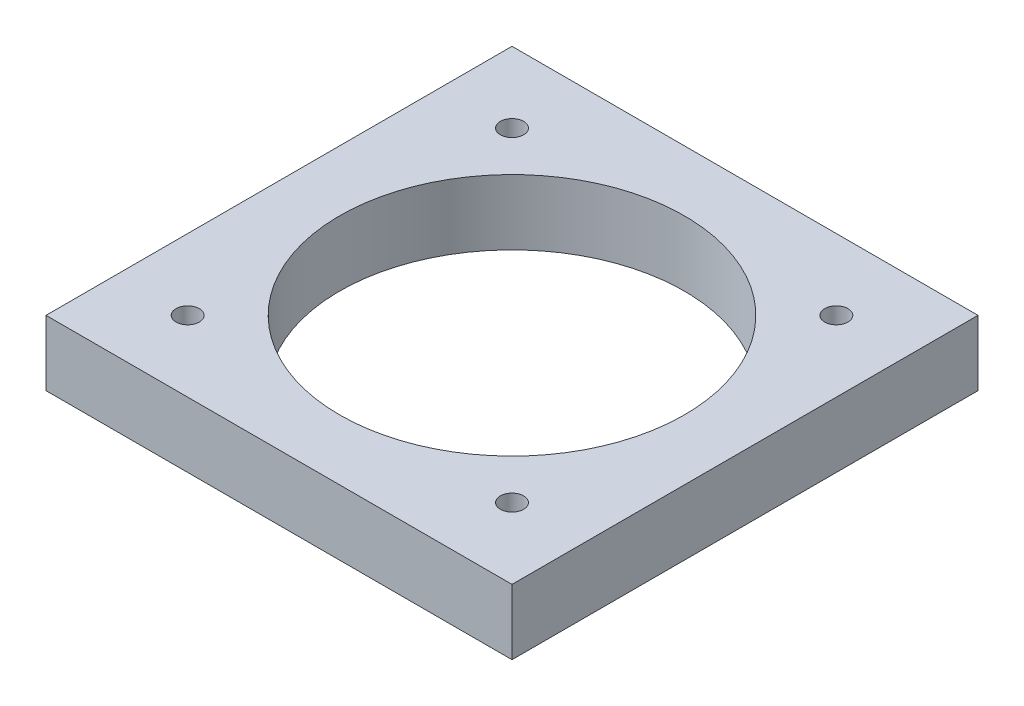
ISO-10303-21;
HEADER;
FILE_DESCRIPTION(('STEP AP214'),'2;1');
FILE_NAME('part.step','',(''),(''),'','','');
FILE_SCHEMA(('AUTOMOTIVE_DESIGN { 1 0 10303 214 1 1 1 1 }'));
ENDSEC;
DATA;
#1=APPLICATION_CONTEXT('core data for automotive mechanical design processes');
#2=APPLICATION_PROTOCOL_DEFINITION('international standard','automotive_design',2000,#1);
#3=PRODUCT_CONTEXT('',#1,'mechanical');
#4=PRODUCT('Part','Part','',(#3));
#5=PRODUCT_RELATED_PRODUCT_CATEGORY('part','',(#4));
#6=PRODUCT_DEFINITION_FORMATION('','',#4);
#7=PRODUCT_DEFINITION_CONTEXT('part definition',#1,'design');
#8=PRODUCT_DEFINITION('design','',#6,#7);
#9=PRODUCT_DEFINITION_SHAPE('','',#8);
#10=(LENGTH_UNIT() NAMED_UNIT(*) SI_UNIT(.MILLI.,.METRE.));
#11=(NAMED_UNIT(*) PLANE_ANGLE_UNIT() SI_UNIT($,.RADIAN.));
#12=(NAMED_UNIT(*) SI_UNIT($,.STERADIAN.) SOLID_ANGLE_UNIT());
#13=UNCERTAINTY_MEASURE_WITH_UNIT(LENGTH_MEASURE(1.E-05),#10,'distance_accuracy_value','');
#14=(GEOMETRIC_REPRESENTATION_CONTEXT(3) GLOBAL_UNCERTAINTY_ASSIGNED_CONTEXT((#13)) GLOBAL_UNIT_ASSIGNED_CONTEXT((#10,
#11,#12)) REPRESENTATION_CONTEXT('',''));
#15=CARTESIAN_POINT('',(0.,0.,0.));
#16=DIRECTION('',(0.,0.,1.));
#17=DIRECTION('',(1.,0.,0.));
#18=AXIS2_PLACEMENT_3D('',#15,#16,#17);
#19=CARTESIAN_POINT('',(26.,7.,-30.2499999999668));
#20=DIRECTION('',(0.,0.,-1.));
#21=DIRECTION('',(-1.,0.,0.));
#22=AXIS2_PLACEMENT_3D('',#19,#20,#21);
#23=CONICAL_SURFACE('',#22,3.39999999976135,1.0297442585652);
#24=CARTESIAN_POINT('',(25.9999999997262,7.,-28.2070738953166));
#25=VERTEX_POINT('',#24);
#26=VERTEX_LOOP('',#25);
#27=FACE_BOUND('',#26,.T.);
#28=CARTESIAN_POINT('',(26.,7.,-30.25));
#29=DIRECTION('',(0.,0.,-1.));
#30=DIRECTION('',(-1.,0.,0.));
#31=AXIS2_PLACEMENT_3D('',#28,#29,#30);
#32=CIRCLE('',#31,3.39999999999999);
#33=CARTESIAN_POINT('',(22.6,7.,-30.25));
#34=VERTEX_POINT('',#33);
#35=EDGE_CURVE('E66',#34,#34,#32,.T.);
#36=ORIENTED_EDGE('',*,*,#35,.T.);
#37=EDGE_LOOP('',(#36));
#38=FACE_BOUND('',#37,.T.);
#39=ADVANCED_FACE('F17',(#27,#38),#23,.F.);
#40=CARTESIAN_POINT('',(-26.,7.,-30.24999999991));
#41=DIRECTION('',(0.,0.,-1.));
#42=DIRECTION('',(0.,1.,0.));
#43=AXIS2_PLACEMENT_3D('',#40,#41,#42);
#44=CONICAL_SURFACE('',#43,3.39999999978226,1.02974425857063);
#45=CARTESIAN_POINT('',(-26.0000000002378,7.,-28.2070738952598));
#46=VERTEX_POINT('',#45);
#47=VERTEX_LOOP('',#46);
#48=FACE_BOUND('',#47,.T.);
#49=CARTESIAN_POINT('',(-26.,7.,-30.25));
#50=DIRECTION('',(0.,0.,-1.));
#51=DIRECTION('',(-1.,0.,0.));
#52=AXIS2_PLACEMENT_3D('',#49,#50,#51);
#53=CIRCLE('',#52,3.39999999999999);
#54=CARTESIAN_POINT('',(-29.4,7.,-30.25));
#55=VERTEX_POINT('',#54);
#56=EDGE_CURVE('E68',#55,#55,#53,.T.);
#57=ORIENTED_EDGE('',*,*,#56,.T.);
#58=EDGE_LOOP('',(#57));
#59=FACE_BOUND('',#58,.T.);
#60=ADVANCED_FACE('F63',(#48,#59),#44,.F.);
#61=CARTESIAN_POINT('',(26.,7.,-50.));
#62=DIRECTION('',(0.,0.,-1.));
#63=DIRECTION('',(-1.,0.,0.));
#64=AXIS2_PLACEMENT_3D('',#61,#62,#63);
#65=CYLINDRICAL_SURFACE('',#64,3.39999999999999);
#66=ORIENTED_EDGE('',*,*,#35,.F.);
#67=EDGE_LOOP('',(#66));
#68=FACE_BOUND('',#67,.T.);
#69=CARTESIAN_POINT('',(26.,7.,-50.));
#70=DIRECTION('',(0.,0.,-1.));
#71=DIRECTION('',(-1.,0.,0.));
#72=AXIS2_PLACEMENT_3D('',#69,#70,#71);
#73=CIRCLE('',#72,3.39999999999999);
#74=CARTESIAN_POINT('',(22.6,7.,-50.));
#75=VERTEX_POINT('',#74);
#76=EDGE_CURVE('E95',#75,#75,#73,.T.);
#77=ORIENTED_EDGE('',*,*,#76,.T.);
#78=EDGE_LOOP('',(#77));
#79=FACE_BOUND('',#78,.T.);
#80=ADVANCED_FACE('F169',(#68,#79),#65,.F.);
#81=CARTESIAN_POINT('',(-26.,7.,-50.));
#82=DIRECTION('',(0.,0.,-1.));
#83=DIRECTION('',(-1.,0.,0.));
#84=AXIS2_PLACEMENT_3D('',#81,#82,#83);
#85=CYLINDRICAL_SURFACE('',#84,3.39999999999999);
#86=ORIENTED_EDGE('',*,*,#56,.F.);
#87=EDGE_LOOP('',(#86));
#88=FACE_BOUND('',#87,.T.);
#89=CARTESIAN_POINT('',(-26.,7.,-50.));
#90=DIRECTION('',(0.,0.,-1.));
#91=DIRECTION('',(-1.,0.,0.));
#92=AXIS2_PLACEMENT_3D('',#89,#90,#91);
#93=CIRCLE('',#92,3.39999999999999);
#94=CARTESIAN_POINT('',(-29.4,7.,-50.));
#95=VERTEX_POINT('',#94);
#96=EDGE_CURVE('E91',#95,#95,#93,.T.);
#97=ORIENTED_EDGE('',*,*,#96,.T.);
#98=EDGE_LOOP('',(#97));
#99=FACE_BOUND('',#98,.T.);
#100=ADVANCED_FACE('F165',(#88,#99),#85,.F.);
#101=CARTESIAN_POINT('',(0.,0.,0.));
#102=DIRECTION('',(0.,1.,0.));
#103=DIRECTION('',(0.,0.,1.));
#104=AXIS2_PLACEMENT_3D('',#101,#102,#103);
#105=PLANE('',#104);
#106=DIRECTION('',(-1.,0.,0.));
#107=VECTOR('',#106,1.);
#108=CARTESIAN_POINT('',(-50.,0.,50.));
#109=LINE('',#108,#107);
#110=CARTESIAN_POINT('',(50.,0.,50.));
#111=VERTEX_POINT('',#110);
#112=CARTESIAN_POINT('',(-50.,0.,50.));
#113=VERTEX_POINT('',#112);
#114=EDGE_CURVE('E90',#111,#113,#109,.T.);
#115=ORIENTED_EDGE('',*,*,#114,.T.);
#116=DIRECTION('',(0.,0.,-1.));
#117=VECTOR('',#116,1.);
#118=CARTESIAN_POINT('',(-50.,0.,-50.));
#119=LINE('',#118,#117);
#120=CARTESIAN_POINT('',(-50.,0.,-50.));
#121=VERTEX_POINT('',#120);
#122=EDGE_CURVE('E335',#113,#121,#119,.T.);
#123=ORIENTED_EDGE('',*,*,#122,.T.);
#124=DIRECTION('',(1.,0.,0.));
#125=VECTOR('',#124,1.);
#126=CARTESIAN_POINT('',(-50.,0.,-50.));
#127=LINE('',#126,#125);
#128=CARTESIAN_POINT('',(50.,0.,-50.));
#129=VERTEX_POINT('',#128);
#130=EDGE_CURVE('E347',#121,#129,#127,.T.);
#131=ORIENTED_EDGE('',*,*,#130,.T.);
#132=DIRECTION('',(0.,0.,1.));
#133=VECTOR('',#132,1.);
#134=CARTESIAN_POINT('',(50.,0.,-50.));
#135=LINE('',#134,#133);
#136=EDGE_CURVE('E98',#129,#111,#135,.T.);
#137=ORIENTED_EDGE('',*,*,#136,.T.);
#138=EDGE_LOOP('',(#115,#123,#131,#137));
#139=FACE_BOUND('',#138,.T.);
#140=CARTESIAN_POINT('',(0.,0.,0.));
#141=DIRECTION('',(0.,1.,0.));
#142=DIRECTION('',(0.,0.,1.));
#143=AXIS2_PLACEMENT_3D('',#140,#141,#142);
#144=CIRCLE('',#143,37.);
#145=CARTESIAN_POINT('',(0.,0.,37.));
#146=VERTEX_POINT('',#145);
#147=EDGE_CURVE('E99',#146,#146,#144,.T.);
#148=ORIENTED_EDGE('',*,*,#147,.T.);
#149=EDGE_LOOP('',(#148));
#150=FACE_BOUND('',#149,.T.);
#151=CARTESIAN_POINT('',(34.8,0.,-34.8));
#152=DIRECTION('',(0.,-1.,0.));
#153=DIRECTION('',(0.,0.,-1.));
#154=AXIS2_PLACEMENT_3D('',#151,#152,#153);
#155=CIRCLE('',#154,2.5);
#156=CARTESIAN_POINT('',(34.8,0.,-37.3));
#157=VERTEX_POINT('',#156);
#158=EDGE_CURVE('E102',#157,#157,#155,.F.);
#159=ORIENTED_EDGE('',*,*,#158,.T.);
#160=EDGE_LOOP('',(#159));
#161=FACE_BOUND('',#160,.T.);
#162=CARTESIAN_POINT('',(34.8000000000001,0.,34.8));
#163=DIRECTION('',(0.,-1.,0.));
#164=DIRECTION('',(0.,0.,-1.));
#165=AXIS2_PLACEMENT_3D('',#162,#163,#164);
#166=CIRCLE('',#165,2.5);
#167=CARTESIAN_POINT('',(34.8000000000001,0.,32.3));
#168=VERTEX_POINT('',#167);
#169=EDGE_CURVE('E105',#168,#168,#166,.F.);
#170=ORIENTED_EDGE('',*,*,#169,.T.);
#171=EDGE_LOOP('',(#170));
#172=FACE_BOUND('',#171,.T.);
#173=CARTESIAN_POINT('',(-34.7999999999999,0.,34.8000000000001));
#174=DIRECTION('',(0.,-1.,0.));
#175=DIRECTION('',(0.,0.,-1.));
#176=AXIS2_PLACEMENT_3D('',#173,#174,#175);
#177=CIRCLE('',#176,2.5);
#178=CARTESIAN_POINT('',(-34.7999999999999,0.,32.3000000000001));
#179=VERTEX_POINT('',#178);
#180=EDGE_CURVE('E107',#179,#179,#177,.F.);
#181=ORIENTED_EDGE('',*,*,#180,.T.);
#182=EDGE_LOOP('',(#181));
#183=FACE_BOUND('',#182,.T.);
#184=CARTESIAN_POINT('',(-34.8,0.,-34.7999999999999));
#185=DIRECTION('',(0.,-1.,0.));
#186=DIRECTION('',(0.,0.,-1.));
#187=AXIS2_PLACEMENT_3D('',#184,#185,#186);
#188=CIRCLE('',#187,2.5);
#189=CARTESIAN_POINT('',(-34.8,0.,-37.2999999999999));
#190=VERTEX_POINT('',#189);
#191=EDGE_CURVE('E20',#190,#190,#188,.F.);
#192=ORIENTED_EDGE('',*,*,#191,.T.);
#193=EDGE_LOOP('',(#192));
#194=FACE_BOUND('',#193,.T.);
#195=ADVANCED_FACE('F114',(#139,#150,#161,#172,#183,#194),#105,.F.);
#196=CARTESIAN_POINT('',(-34.8,0.,-34.7999999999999));
#197=DIRECTION('',(0.,-1.,0.));
#198=DIRECTION('',(0.,0.,-1.));
#199=AXIS2_PLACEMENT_3D('',#196,#197,#198);
#200=CYLINDRICAL_SURFACE('',#199,2.5);
#201=ORIENTED_EDGE('',*,*,#191,.F.);
#202=EDGE_LOOP('',(#201));
#203=FACE_BOUND('',#202,.T.);
#204=CARTESIAN_POINT('',(-34.8,14.,-34.7999999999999));
#205=DIRECTION('',(0.,-1.,0.));
#206=DIRECTION('',(0.,0.,-1.));
#207=AXIS2_PLACEMENT_3D('',#204,#205,#206);
#208=CIRCLE('',#207,2.5);
#209=CARTESIAN_POINT('',(-34.8,14.,-37.2999999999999));
#210=VERTEX_POINT('',#209);
#211=EDGE_CURVE('E87',#210,#210,#208,.T.);
#212=ORIENTED_EDGE('',*,*,#211,.F.);
#213=EDGE_LOOP('',(#212));
#214=FACE_BOUND('',#213,.T.);
#215=ADVANCED_FACE('F116',(#203,#214),#200,.F.);
#216=CARTESIAN_POINT('',(-34.7999999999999,0.,34.8000000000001));
#217=DIRECTION('',(0.,-1.,0.));
#218=DIRECTION('',(0.,0.,-1.));
#219=AXIS2_PLACEMENT_3D('',#216,#217,#218);
#220=CYLINDRICAL_SURFACE('',#219,2.5);
#221=ORIENTED_EDGE('',*,*,#180,.F.);
#222=EDGE_LOOP('',(#221));
#223=FACE_BOUND('',#222,.T.);
#224=CARTESIAN_POINT('',(-34.7999999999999,14.,34.8000000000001));
#225=DIRECTION('',(0.,-1.,0.));
#226=DIRECTION('',(0.,0.,-1.));
#227=AXIS2_PLACEMENT_3D('',#224,#225,#226);
#228=CIRCLE('',#227,2.5);
#229=CARTESIAN_POINT('',(-34.7999999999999,14.,32.3000000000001));
#230=VERTEX_POINT('',#229);
#231=EDGE_CURVE('E84',#230,#230,#228,.T.);
#232=ORIENTED_EDGE('',*,*,#231,.F.);
#233=EDGE_LOOP('',(#232));
#234=FACE_BOUND('',#233,.T.);
#235=ADVANCED_FACE('F119',(#223,#234),#220,.F.);
#236=CARTESIAN_POINT('',(34.8000000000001,0.,34.8));
#237=DIRECTION('',(0.,-1.,0.));
#238=DIRECTION('',(0.,0.,-1.));
#239=AXIS2_PLACEMENT_3D('',#236,#237,#238);
#240=CYLINDRICAL_SURFACE('',#239,2.5);
#241=ORIENTED_EDGE('',*,*,#169,.F.);
#242=EDGE_LOOP('',(#241));
#243=FACE_BOUND('',#242,.T.);
#244=CARTESIAN_POINT('',(34.8000000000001,14.,34.8));
#245=DIRECTION('',(0.,-1.,0.));
#246=DIRECTION('',(0.,0.,-1.));
#247=AXIS2_PLACEMENT_3D('',#244,#245,#246);
#248=CIRCLE('',#247,2.5);
#249=CARTESIAN_POINT('',(34.8000000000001,14.,32.3));
#250=VERTEX_POINT('',#249);
#251=EDGE_CURVE('E81',#250,#250,#248,.T.);
#252=ORIENTED_EDGE('',*,*,#251,.F.);
#253=EDGE_LOOP('',(#252));
#254=FACE_BOUND('',#253,.T.);
#255=ADVANCED_FACE('F155',(#243,#254),#240,.F.);
#256=CARTESIAN_POINT('',(34.8,0.,-34.8));
#257=DIRECTION('',(0.,-1.,0.));
#258=DIRECTION('',(0.,0.,-1.));
#259=AXIS2_PLACEMENT_3D('',#256,#257,#258);
#260=CYLINDRICAL_SURFACE('',#259,2.5);
#261=ORIENTED_EDGE('',*,*,#158,.F.);
#262=EDGE_LOOP('',(#261));
#263=FACE_BOUND('',#262,.T.);
#264=CARTESIAN_POINT('',(34.8,14.,-34.8));
#265=DIRECTION('',(0.,-1.,0.));
#266=DIRECTION('',(0.,0.,-1.));
#267=AXIS2_PLACEMENT_3D('',#264,#265,#266);
#268=CIRCLE('',#267,2.5);
#269=CARTESIAN_POINT('',(34.8,14.,-37.3));
#270=VERTEX_POINT('',#269);
#271=EDGE_CURVE('E78',#270,#270,#268,.T.);
#272=ORIENTED_EDGE('',*,*,#271,.F.);
#273=EDGE_LOOP('',(#272));
#274=FACE_BOUND('',#273,.T.);
#275=ADVANCED_FACE('F151',(#263,#274),#260,.F.);
#276=CARTESIAN_POINT('',(0.,0.,0.));
#277=DIRECTION('',(0.,1.,0.));
#278=DIRECTION('',(0.,0.,1.));
#279=AXIS2_PLACEMENT_3D('',#276,#277,#278);
#280=CYLINDRICAL_SURFACE('',#279,37.);
#281=CARTESIAN_POINT('',(0.,14.,0.));
#282=DIRECTION('',(0.,1.,0.));
#283=DIRECTION('',(0.,0.,1.));
#284=AXIS2_PLACEMENT_3D('',#281,#282,#283);
#285=CIRCLE('',#284,37.);
#286=CARTESIAN_POINT('',(0.,14.,37.));
#287=VERTEX_POINT('',#286);
#288=EDGE_CURVE('E74',#287,#287,#285,.F.);
#289=ORIENTED_EDGE('',*,*,#288,.F.);
#290=EDGE_LOOP('',(#289));
#291=FACE_BOUND('',#290,.T.);
#292=ORIENTED_EDGE('',*,*,#147,.F.);
#293=EDGE_LOOP('',(#292));
#294=FACE_BOUND('',#293,.T.);
#295=ADVANCED_FACE('F147',(#291,#294),#280,.F.);
#296=CARTESIAN_POINT('',(50.,14.,-50.));
#297=DIRECTION('',(-1.,0.,0.));
#298=DIRECTION('',(0.,0.,1.));
#299=AXIS2_PLACEMENT_3D('',#296,#297,#298);
#300=PLANE('',#299);
#301=DIRECTION('',(0.,1.,0.));
#302=VECTOR('',#301,1.);
#303=CARTESIAN_POINT('',(50.,14.,-50.));
#304=LINE('',#303,#302);
#305=CARTESIAN_POINT('',(50.,14.,-50.));
#306=VERTEX_POINT('',#305);
#307=EDGE_CURVE('E94',#129,#306,#304,.T.);
#308=ORIENTED_EDGE('',*,*,#307,.T.);
#309=DIRECTION('',(0.,0.,1.));
#310=VECTOR('',#309,1.);
#311=CARTESIAN_POINT('',(50.,14.,0.));
#312=LINE('',#311,#310);
#313=CARTESIAN_POINT('',(50.,14.,50.));
#314=VERTEX_POINT('',#313);
#315=EDGE_CURVE('E77',#314,#306,#312,.F.);
#316=ORIENTED_EDGE('',*,*,#315,.F.);
#317=DIRECTION('',(0.,1.,0.));
#318=VECTOR('',#317,1.);
#319=CARTESIAN_POINT('',(50.,14.,50.));
#320=LINE('',#319,#318);
#321=EDGE_CURVE('E339',#314,#111,#320,.F.);
#322=ORIENTED_EDGE('',*,*,#321,.T.);
#323=ORIENTED_EDGE('',*,*,#136,.F.);
#324=EDGE_LOOP('',(#308,#316,#322,#323));
#325=FACE_BOUND('',#324,.T.);
#326=ADVANCED_FACE('F143',(#325),#300,.F.);
#327=CARTESIAN_POINT('',(-50.,14.,-50.));
#328=DIRECTION('',(0.,0.,1.));
#329=DIRECTION('',(1.,0.,0.));
#330=AXIS2_PLACEMENT_3D('',#327,#328,#329);
#331=PLANE('',#330);
#332=DIRECTION('',(0.,1.,0.));
#333=VECTOR('',#332,1.);
#334=CARTESIAN_POINT('',(-50.,14.,-50.));
#335=LINE('',#334,#333);
#336=CARTESIAN_POINT('',(-50.,14.,-50.));
#337=VERTEX_POINT('',#336);
#338=EDGE_CURVE('E343',#121,#337,#335,.T.);
#339=ORIENTED_EDGE('',*,*,#338,.T.);
#340=DIRECTION('',(1.,0.,0.));
#341=VECTOR('',#340,1.);
#342=CARTESIAN_POINT('',(0.,14.,-50.));
#343=LINE('',#342,#341);
#344=EDGE_CURVE('E353',#306,#337,#343,.F.);
#345=ORIENTED_EDGE('',*,*,#344,.F.);
#346=ORIENTED_EDGE('',*,*,#307,.F.);
#347=ORIENTED_EDGE('',*,*,#130,.F.);
#348=EDGE_LOOP('',(#339,#345,#346,#347));
#349=FACE_BOUND('',#348,.T.);
#350=ORIENTED_EDGE('',*,*,#96,.F.);
#351=EDGE_LOOP('',(#350));
#352=FACE_BOUND('',#351,.T.);
#353=ORIENTED_EDGE('',*,*,#76,.F.);
#354=EDGE_LOOP('',(#353));
#355=FACE_BOUND('',#354,.T.);
#356=ADVANCED_FACE('F140',(#349,#352,#355),#331,.F.);
#357=CARTESIAN_POINT('',(-50.,14.,-50.));
#358=DIRECTION('',(1.,0.,0.));
#359=DIRECTION('',(0.,0.,-1.));
#360=AXIS2_PLACEMENT_3D('',#357,#358,#359);
#361=PLANE('',#360);
#362=DIRECTION('',(0.,1.,0.));
#363=VECTOR('',#362,1.);
#364=CARTESIAN_POINT('',(-50.,14.,50.));
#365=LINE('',#364,#363);
#366=CARTESIAN_POINT('',(-50.,14.,50.));
#367=VERTEX_POINT('',#366);
#368=EDGE_CURVE('E35',#113,#367,#365,.T.);
#369=ORIENTED_EDGE('',*,*,#368,.T.);
#370=DIRECTION('',(0.,0.,1.));
#371=VECTOR('',#370,1.);
#372=CARTESIAN_POINT('',(-50.,14.,0.));
#373=LINE('',#372,#371);
#374=EDGE_CURVE('E26',#337,#367,#373,.T.);
#375=ORIENTED_EDGE('',*,*,#374,.F.);
#376=ORIENTED_EDGE('',*,*,#338,.F.);
#377=ORIENTED_EDGE('',*,*,#122,.F.);
#378=EDGE_LOOP('',(#369,#375,#376,#377));
#379=FACE_BOUND('',#378,.T.);
#380=ADVANCED_FACE('F132',(#379),#361,.F.);
#381=CARTESIAN_POINT('',(-50.,14.,50.));
#382=DIRECTION('',(0.,0.,-1.));
#383=DIRECTION('',(-1.,0.,0.));
#384=AXIS2_PLACEMENT_3D('',#381,#382,#383);
#385=PLANE('',#384);
#386=ORIENTED_EDGE('',*,*,#321,.F.);
#387=DIRECTION('',(1.,0.,0.));
#388=VECTOR('',#387,1.);
#389=CARTESIAN_POINT('',(0.,14.,50.));
#390=LINE('',#389,#388);
#391=EDGE_CURVE('E11',#367,#314,#390,.T.);
#392=ORIENTED_EDGE('',*,*,#391,.F.);
#393=ORIENTED_EDGE('',*,*,#368,.F.);
#394=ORIENTED_EDGE('',*,*,#114,.F.);
#395=EDGE_LOOP('',(#386,#392,#393,#394));
#396=FACE_BOUND('',#395,.T.);
#397=ADVANCED_FACE('F125',(#396),#385,.F.);
#398=CARTESIAN_POINT('',(0.,14.,0.));
#399=DIRECTION('',(0.,1.,0.));
#400=DIRECTION('',(0.,0.,1.));
#401=AXIS2_PLACEMENT_3D('',#398,#399,#400);
#402=PLANE('',#401);
#403=ORIENTED_EDGE('',*,*,#374,.T.);
#404=ORIENTED_EDGE('',*,*,#391,.T.);
#405=ORIENTED_EDGE('',*,*,#315,.T.);
#406=ORIENTED_EDGE('',*,*,#344,.T.);
#407=EDGE_LOOP('',(#403,#404,#405,#406));
#408=FACE_BOUND('',#407,.T.);
#409=ORIENTED_EDGE('',*,*,#288,.T.);
#410=EDGE_LOOP('',(#409));
#411=FACE_BOUND('',#410,.T.);
#412=ORIENTED_EDGE('',*,*,#271,.T.);
#413=EDGE_LOOP('',(#412));
#414=FACE_BOUND('',#413,.T.);
#415=ORIENTED_EDGE('',*,*,#251,.T.);
#416=EDGE_LOOP('',(#415));
#417=FACE_BOUND('',#416,.T.);
#418=ORIENTED_EDGE('',*,*,#231,.T.);
#419=EDGE_LOOP('',(#418));
#420=FACE_BOUND('',#419,.T.);
#421=ORIENTED_EDGE('',*,*,#211,.T.);
#422=EDGE_LOOP('',(#421));
#423=FACE_BOUND('',#422,.T.);
#424=ADVANCED_FACE('F123',(#408,#411,#414,#417,#420,#423),#402,.T.);
#425=CLOSED_SHELL('',(#39,#60,#80,#100,#195,#215,#235,#255,#275,#295,#326,#356,#380,#397,#424));
#426=MANIFOLD_SOLID_BREP('B1',#425);
#427=ADVANCED_BREP_SHAPE_REPRESENTATION('',(#18,#426),#14);
#428=SHAPE_DEFINITION_REPRESENTATION(#9,#427);
ENDSEC;
END-ISO-10303-21;
